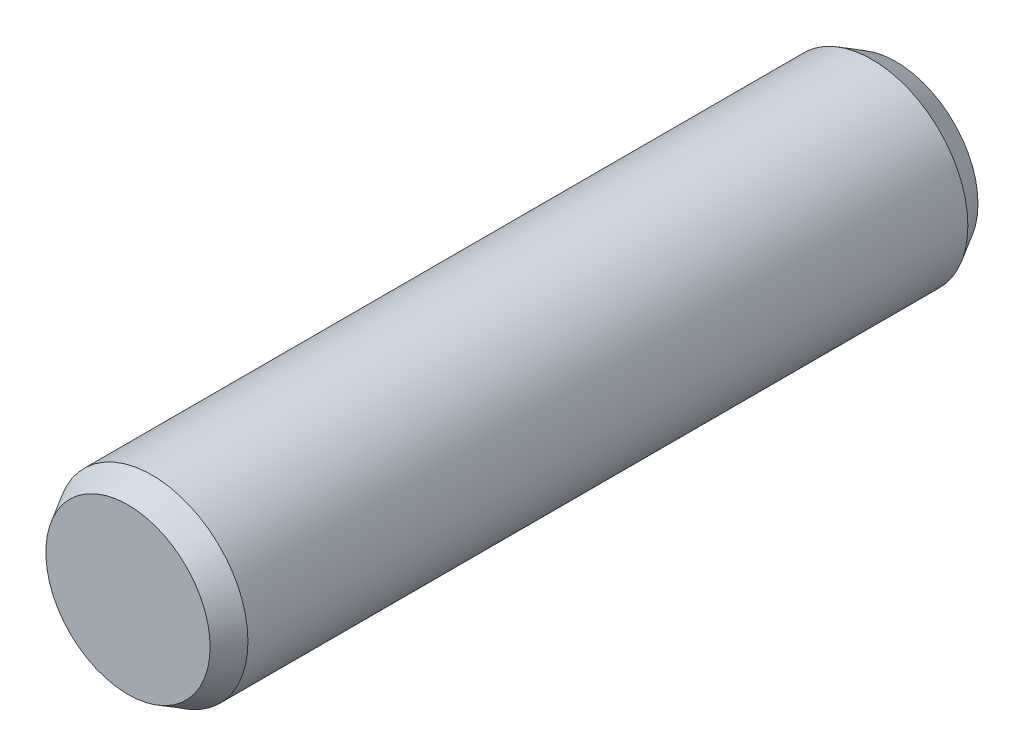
ISO-10303-21;
HEADER;
FILE_DESCRIPTION(('STEP AP214'),'2;1');
FILE_NAME('part.step','',(''),(''),'','','');
FILE_SCHEMA(('AUTOMOTIVE_DESIGN { 1 0 10303 214 1 1 1 1 }'));
ENDSEC;
DATA;
#1=APPLICATION_CONTEXT('core data for automotive mechanical design processes');
#2=APPLICATION_PROTOCOL_DEFINITION('international standard','automotive_design',2000,#1);
#3=PRODUCT_CONTEXT('',#1,'mechanical');
#4=PRODUCT('Part','Part','',(#3));
#5=PRODUCT_RELATED_PRODUCT_CATEGORY('part','',(#4));
#6=PRODUCT_DEFINITION_FORMATION('','',#4);
#7=PRODUCT_DEFINITION_CONTEXT('part definition',#1,'design');
#8=PRODUCT_DEFINITION('design','',#6,#7);
#9=PRODUCT_DEFINITION_SHAPE('','',#8);
#10=(LENGTH_UNIT() NAMED_UNIT(*) SI_UNIT(.MILLI.,.METRE.));
#11=(NAMED_UNIT(*) PLANE_ANGLE_UNIT() SI_UNIT($,.RADIAN.));
#12=(NAMED_UNIT(*) SI_UNIT($,.STERADIAN.) SOLID_ANGLE_UNIT());
#13=UNCERTAINTY_MEASURE_WITH_UNIT(LENGTH_MEASURE(1.E-05),#10,'distance_accuracy_value','');
#14=(GEOMETRIC_REPRESENTATION_CONTEXT(3) GLOBAL_UNCERTAINTY_ASSIGNED_CONTEXT((#13)) GLOBAL_UNIT_ASSIGNED_CONTEXT((#10,
#11,#12)) REPRESENTATION_CONTEXT('',''));
#15=CARTESIAN_POINT('',(0.,0.,0.));
#16=DIRECTION('',(0.,0.,1.));
#17=DIRECTION('',(1.,0.,0.));
#18=AXIS2_PLACEMENT_3D('',#15,#16,#17);
#19=CARTESIAN_POINT('',(50.,10.,32.));
#20=DIRECTION('',(0.,0.,-1.));
#21=DIRECTION('',(-1.,0.,0.));
#22=AXIS2_PLACEMENT_3D('',#19,#20,#21);
#23=CYLINDRICAL_SURFACE('',#22,4.00000000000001);
#24=CARTESIAN_POINT('',(50.,10.,1.));
#25=DIRECTION('',(0.,0.,1.));
#26=DIRECTION('',(1.,0.,0.));
#27=AXIS2_PLACEMENT_3D('',#24,#25,#26);
#28=CIRCLE('',#27,4.00000000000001);
#29=CARTESIAN_POINT('',(54.,10.,1.));
#30=VERTEX_POINT('',#29);
#31=EDGE_CURVE('E32',#30,#30,#28,.T.);
#32=ORIENTED_EDGE('',*,*,#31,.T.);
#33=EDGE_LOOP('',(#32));
#34=FACE_BOUND('',#33,.T.);
#35=CARTESIAN_POINT('',(50.,10.,31.));
#36=DIRECTION('',(0.,0.,1.));
#37=DIRECTION('',(1.,0.,0.));
#38=AXIS2_PLACEMENT_3D('',#35,#36,#37);
#39=CIRCLE('',#38,4.00000000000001);
#40=CARTESIAN_POINT('',(54.,10.,31.));
#41=VERTEX_POINT('',#40);
#42=EDGE_CURVE('E36',#41,#41,#39,.F.);
#43=ORIENTED_EDGE('',*,*,#42,.T.);
#44=EDGE_LOOP('',(#43));
#45=FACE_BOUND('',#44,.T.);
#46=ADVANCED_FACE('F22',(#34,#45),#23,.T.);
#47=CARTESIAN_POINT('',(50.,10.,32.));
#48=DIRECTION('',(0.,0.,1.));
#49=DIRECTION('',(1.,0.,0.));
#50=AXIS2_PLACEMENT_3D('',#47,#48,#49);
#51=PLANE('',#50);
#52=CARTESIAN_POINT('',(50.,10.,32.));
#53=DIRECTION('',(0.,0.,1.));
#54=DIRECTION('',(1.,0.,0.));
#55=AXIS2_PLACEMENT_3D('',#52,#53,#54);
#56=CIRCLE('',#55,3.42264973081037);
#57=CARTESIAN_POINT('',(53.4226497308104,10.,32.));
#58=VERTEX_POINT('',#57);
#59=EDGE_CURVE('E10',#58,#58,#56,.T.);
#60=ORIENTED_EDGE('',*,*,#59,.T.);
#61=EDGE_LOOP('',(#60));
#62=FACE_BOUND('',#61,.T.);
#63=ADVANCED_FACE('F55',(#62),#51,.T.);
#64=CARTESIAN_POINT('',(50.,10.,0.));
#65=DIRECTION('',(0.,0.,1.));
#66=DIRECTION('',(1.,0.,0.));
#67=AXIS2_PLACEMENT_3D('',#64,#65,#66);
#68=PLANE('',#67);
#69=CARTESIAN_POINT('',(50.,10.,0.));
#70=DIRECTION('',(0.,0.,1.));
#71=DIRECTION('',(1.,0.,0.));
#72=AXIS2_PLACEMENT_3D('',#69,#70,#71);
#73=CIRCLE('',#72,3.42264973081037);
#74=CARTESIAN_POINT('',(53.4226497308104,10.,0.));
#75=VERTEX_POINT('',#74);
#76=EDGE_CURVE('E28',#75,#75,#73,.F.);
#77=ORIENTED_EDGE('',*,*,#76,.T.);
#78=EDGE_LOOP('',(#77));
#79=FACE_BOUND('',#78,.T.);
#80=ADVANCED_FACE('F51',(#79),#68,.F.);
#81=CARTESIAN_POINT('',(50.,10.,1.));
#82=DIRECTION('',(0.,0.,1.));
#83=DIRECTION('',(1.,0.,0.));
#84=AXIS2_PLACEMENT_3D('',#81,#82,#83);
#85=CONICAL_SURFACE('',#84,4.00000000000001,0.523598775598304);
#86=ORIENTED_EDGE('',*,*,#76,.F.);
#87=EDGE_LOOP('',(#86));
#88=FACE_BOUND('',#87,.T.);
#89=ORIENTED_EDGE('',*,*,#31,.F.);
#90=EDGE_LOOP('',(#89));
#91=FACE_BOUND('',#90,.T.);
#92=ADVANCED_FACE('F46',(#88,#91),#85,.T.);
#93=CARTESIAN_POINT('',(50.,10.,32.));
#94=DIRECTION('',(0.,0.,-1.));
#95=DIRECTION('',(-1.,0.,0.));
#96=AXIS2_PLACEMENT_3D('',#93,#94,#95);
#97=CONICAL_SURFACE('',#96,3.42264973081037,0.523598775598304);
#98=ORIENTED_EDGE('',*,*,#42,.F.);
#99=EDGE_LOOP('',(#98));
#100=FACE_BOUND('',#99,.T.);
#101=ORIENTED_EDGE('',*,*,#59,.F.);
#102=EDGE_LOOP('',(#101));
#103=FACE_BOUND('',#102,.T.);
#104=ADVANCED_FACE('F43',(#100,#103),#97,.T.);
#105=CLOSED_SHELL('',(#46,#63,#80,#92,#104));
#106=MANIFOLD_SOLID_BREP('B2',#105);
#107=ADVANCED_BREP_SHAPE_REPRESENTATION('',(#18,#106),#14);
#108=SHAPE_DEFINITION_REPRESENTATION(#9,#107);
ENDSEC;
END-ISO-10303-21;
